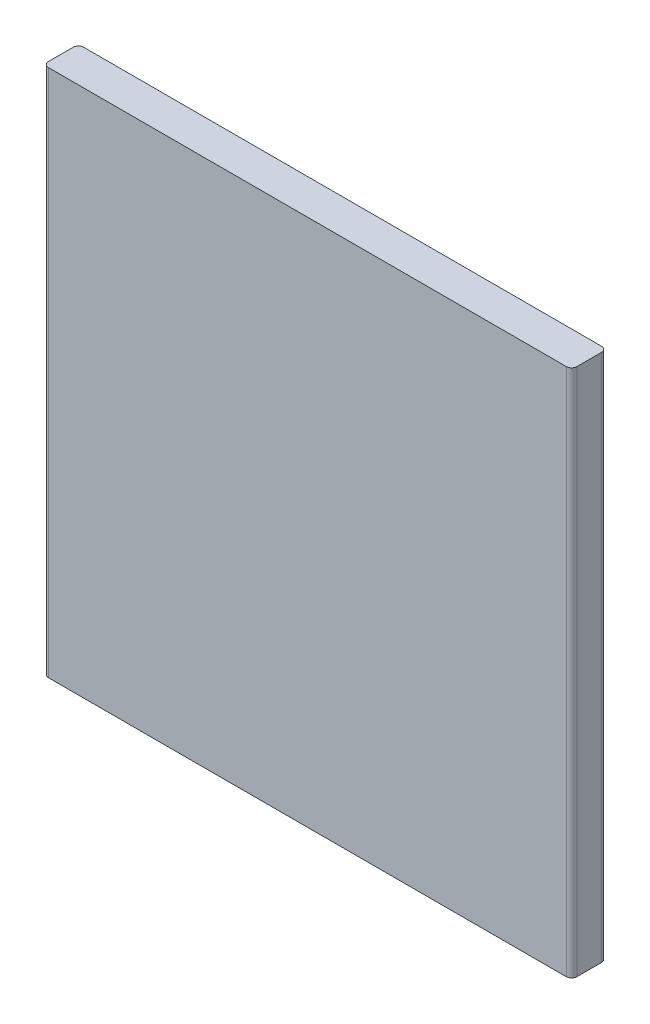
ISO-10303-21;
HEADER;
FILE_DESCRIPTION(('STEP AP214'),'2;1');
FILE_NAME('part.step','',(''),(''),'','','');
FILE_SCHEMA(('AUTOMOTIVE_DESIGN { 1 0 10303 214 1 1 1 1 }'));
ENDSEC;
DATA;
#1=APPLICATION_CONTEXT('core data for automotive mechanical design processes');
#2=APPLICATION_PROTOCOL_DEFINITION('international standard','automotive_design',2000,#1);
#3=PRODUCT_CONTEXT('',#1,'mechanical');
#4=PRODUCT('Part','Part','',(#3));
#5=PRODUCT_RELATED_PRODUCT_CATEGORY('part','',(#4));
#6=PRODUCT_DEFINITION_FORMATION('','',#4);
#7=PRODUCT_DEFINITION_CONTEXT('part definition',#1,'design');
#8=PRODUCT_DEFINITION('design','',#6,#7);
#9=PRODUCT_DEFINITION_SHAPE('','',#8);
#10=(LENGTH_UNIT() NAMED_UNIT(*) SI_UNIT(.MILLI.,.METRE.));
#11=(NAMED_UNIT(*) PLANE_ANGLE_UNIT() SI_UNIT($,.RADIAN.));
#12=(NAMED_UNIT(*) SI_UNIT($,.STERADIAN.) SOLID_ANGLE_UNIT());
#13=UNCERTAINTY_MEASURE_WITH_UNIT(LENGTH_MEASURE(1.E-05),#10,'distance_accuracy_value','');
#14=(GEOMETRIC_REPRESENTATION_CONTEXT(3) GLOBAL_UNCERTAINTY_ASSIGNED_CONTEXT((#13)) GLOBAL_UNIT_ASSIGNED_CONTEXT((#10,
#11,#12)) REPRESENTATION_CONTEXT('',''));
#15=CARTESIAN_POINT('',(0.,0.,0.));
#16=DIRECTION('',(0.,0.,1.));
#17=DIRECTION('',(1.,0.,0.));
#18=AXIS2_PLACEMENT_3D('',#15,#16,#17);
#19=CARTESIAN_POINT('',(0.,0.,2.));
#20=DIRECTION('',(1.,0.,0.));
#21=DIRECTION('',(0.,0.,-1.));
#22=AXIS2_PLACEMENT_3D('',#19,#20,#21);
#23=PLANE('',#22);
#24=DIRECTION('',(0.,0.,-1.));
#25=VECTOR('',#24,1.);
#26=CARTESIAN_POINT('',(0.,30.,2.));
#27=LINE('',#26,#25);
#28=CARTESIAN_POINT('',(0.,30.,1.7));
#29=VERTEX_POINT('',#28);
#30=CARTESIAN_POINT('',(0.,30.,0.3));
#31=VERTEX_POINT('',#30);
#32=EDGE_CURVE('E140',#29,#31,#27,.T.);
#33=ORIENTED_EDGE('',*,*,#32,.T.);
#34=DIRECTION('',(0.,-1.,0.));
#35=VECTOR('',#34,1.);
#36=CARTESIAN_POINT('',(0.,0.,0.3));
#37=LINE('',#36,#35);
#38=CARTESIAN_POINT('',(0.,0.,0.3));
#39=VERTEX_POINT('',#38);
#40=EDGE_CURVE('E11',#31,#39,#37,.T.);
#41=ORIENTED_EDGE('',*,*,#40,.T.);
#42=DIRECTION('',(0.,0.,-1.));
#43=VECTOR('',#42,1.);
#44=CARTESIAN_POINT('',(0.,0.,2.));
#45=LINE('',#44,#43);
#46=CARTESIAN_POINT('',(0.,0.,1.7));
#47=VERTEX_POINT('',#46);
#48=EDGE_CURVE('E129',#47,#39,#45,.T.);
#49=ORIENTED_EDGE('',*,*,#48,.F.);
#50=DIRECTION('',(0.,-1.,0.));
#51=VECTOR('',#50,1.);
#52=CARTESIAN_POINT('',(0.,0.,1.7));
#53=LINE('',#52,#51);
#54=EDGE_CURVE('E54',#47,#29,#53,.F.);
#55=ORIENTED_EDGE('',*,*,#54,.T.);
#56=EDGE_LOOP('',(#33,#41,#49,#55));
#57=FACE_BOUND('',#56,.T.);
#58=ADVANCED_FACE('F45',(#57),#23,.F.);
#59=CARTESIAN_POINT('',(0.,0.,2.));
#60=DIRECTION('',(0.,1.,0.));
#61=DIRECTION('',(0.,0.,1.));
#62=AXIS2_PLACEMENT_3D('',#59,#60,#61);
#63=PLANE('',#62);
#64=DIRECTION('',(0.,0.,-1.));
#65=VECTOR('',#64,1.);
#66=CARTESIAN_POINT('',(30.,0.,2.));
#67=LINE('',#66,#65);
#68=CARTESIAN_POINT('',(30.,0.,1.7));
#69=VERTEX_POINT('',#68);
#70=CARTESIAN_POINT('',(30.,0.,0.3));
#71=VERTEX_POINT('',#70);
#72=EDGE_CURVE('E156',#69,#71,#67,.T.);
#73=ORIENTED_EDGE('',*,*,#72,.F.);
#74=CARTESIAN_POINT('',(29.7,0.,1.7));
#75=DIRECTION('',(0.,1.,0.));
#76=DIRECTION('',(0.,0.,1.));
#77=AXIS2_PLACEMENT_3D('',#74,#75,#76);
#78=CIRCLE('',#77,0.3);
#79=CARTESIAN_POINT('',(29.7,0.,2.));
#80=VERTEX_POINT('',#79);
#81=EDGE_CURVE('E134',#69,#80,#78,.F.);
#82=ORIENTED_EDGE('',*,*,#81,.T.);
#83=DIRECTION('',(1.,0.,0.));
#84=VECTOR('',#83,1.);
#85=CARTESIAN_POINT('',(0.,0.,2.));
#86=LINE('',#85,#84);
#87=CARTESIAN_POINT('',(0.3,0.,2.));
#88=VERTEX_POINT('',#87);
#89=EDGE_CURVE('E123',#88,#80,#86,.T.);
#90=ORIENTED_EDGE('',*,*,#89,.F.);
#91=CARTESIAN_POINT('',(0.3,0.,1.7));
#92=DIRECTION('',(0.,1.,0.));
#93=DIRECTION('',(0.,0.,1.));
#94=AXIS2_PLACEMENT_3D('',#91,#92,#93);
#95=CIRCLE('',#94,0.3);
#96=EDGE_CURVE('E68',#88,#47,#95,.F.);
#97=ORIENTED_EDGE('',*,*,#96,.T.);
#98=ORIENTED_EDGE('',*,*,#48,.T.);
#99=CARTESIAN_POINT('',(0.3,0.,0.3));
#100=DIRECTION('',(0.,1.,0.));
#101=DIRECTION('',(0.,0.,1.));
#102=AXIS2_PLACEMENT_3D('',#99,#100,#101);
#103=CIRCLE('',#102,0.3);
#104=CARTESIAN_POINT('',(0.3,0.,0.));
#105=VERTEX_POINT('',#104);
#106=EDGE_CURVE('E61',#39,#105,#103,.F.);
#107=ORIENTED_EDGE('',*,*,#106,.T.);
#108=DIRECTION('',(1.,0.,0.));
#109=VECTOR('',#108,1.);
#110=CARTESIAN_POINT('',(0.,0.,0.));
#111=LINE('',#110,#109);
#112=CARTESIAN_POINT('',(29.7,0.,0.));
#113=VERTEX_POINT('',#112);
#114=EDGE_CURVE('E143',#105,#113,#111,.T.);
#115=ORIENTED_EDGE('',*,*,#114,.T.);
#116=CARTESIAN_POINT('',(29.7,0.,0.3));
#117=DIRECTION('',(0.,1.,0.));
#118=DIRECTION('',(0.,0.,1.));
#119=AXIS2_PLACEMENT_3D('',#116,#117,#118);
#120=CIRCLE('',#119,0.3);
#121=EDGE_CURVE('E184',#113,#71,#120,.F.);
#122=ORIENTED_EDGE('',*,*,#121,.T.);
#123=EDGE_LOOP('',(#73,#82,#90,#97,#98,#107,#115,#122));
#124=FACE_BOUND('',#123,.T.);
#125=ADVANCED_FACE('F132',(#124),#63,.F.);
#126=CARTESIAN_POINT('',(30.,0.,2.));
#127=DIRECTION('',(-1.,0.,0.));
#128=DIRECTION('',(0.,0.,1.));
#129=AXIS2_PLACEMENT_3D('',#126,#127,#128);
#130=PLANE('',#129);
#131=DIRECTION('',(0.,0.,-1.));
#132=VECTOR('',#131,1.);
#133=CARTESIAN_POINT('',(30.,30.,2.));
#134=LINE('',#133,#132);
#135=CARTESIAN_POINT('',(30.,30.,1.7));
#136=VERTEX_POINT('',#135);
#137=CARTESIAN_POINT('',(30.,30.,0.3));
#138=VERTEX_POINT('',#137);
#139=EDGE_CURVE('E152',#136,#138,#134,.T.);
#140=ORIENTED_EDGE('',*,*,#139,.F.);
#141=DIRECTION('',(0.,1.,0.));
#142=VECTOR('',#141,1.);
#143=CARTESIAN_POINT('',(30.,0.,1.7));
#144=LINE('',#143,#142);
#145=EDGE_CURVE('E116',#136,#69,#144,.F.);
#146=ORIENTED_EDGE('',*,*,#145,.T.);
#147=ORIENTED_EDGE('',*,*,#72,.T.);
#148=DIRECTION('',(0.,1.,0.));
#149=VECTOR('',#148,1.);
#150=CARTESIAN_POINT('',(30.,30.,0.3));
#151=LINE('',#150,#149);
#152=EDGE_CURVE('E176',#71,#138,#151,.T.);
#153=ORIENTED_EDGE('',*,*,#152,.T.);
#154=EDGE_LOOP('',(#140,#146,#147,#153));
#155=FACE_BOUND('',#154,.T.);
#156=ADVANCED_FACE('F212',(#155),#130,.F.);
#157=CARTESIAN_POINT('',(0.,30.,2.));
#158=DIRECTION('',(0.,-1.,0.));
#159=DIRECTION('',(0.,0.,-1.));
#160=AXIS2_PLACEMENT_3D('',#157,#158,#159);
#161=PLANE('',#160);
#162=DIRECTION('',(-1.,0.,0.));
#163=VECTOR('',#162,1.);
#164=CARTESIAN_POINT('',(0.,30.,2.));
#165=LINE('',#164,#163);
#166=CARTESIAN_POINT('',(29.7,30.,2.));
#167=VERTEX_POINT('',#166);
#168=CARTESIAN_POINT('',(0.3,30.,2.));
#169=VERTEX_POINT('',#168);
#170=EDGE_CURVE('E126',#167,#169,#165,.T.);
#171=ORIENTED_EDGE('',*,*,#170,.F.);
#172=CARTESIAN_POINT('',(29.7,30.,1.7));
#173=DIRECTION('',(0.,-1.,0.));
#174=DIRECTION('',(0.,0.,-1.));
#175=AXIS2_PLACEMENT_3D('',#172,#173,#174);
#176=CIRCLE('',#175,0.3);
#177=EDGE_CURVE('E173',#167,#136,#176,.F.);
#178=ORIENTED_EDGE('',*,*,#177,.T.);
#179=ORIENTED_EDGE('',*,*,#139,.T.);
#180=CARTESIAN_POINT('',(29.7,30.,0.3));
#181=DIRECTION('',(0.,-1.,0.));
#182=DIRECTION('',(0.,0.,-1.));
#183=AXIS2_PLACEMENT_3D('',#180,#181,#182);
#184=CIRCLE('',#183,0.3);
#185=CARTESIAN_POINT('',(29.7,30.,0.));
#186=VERTEX_POINT('',#185);
#187=EDGE_CURVE('E170',#138,#186,#184,.F.);
#188=ORIENTED_EDGE('',*,*,#187,.T.);
#189=DIRECTION('',(-1.,0.,0.));
#190=VECTOR('',#189,1.);
#191=CARTESIAN_POINT('',(0.,30.,0.));
#192=LINE('',#191,#190);
#193=CARTESIAN_POINT('',(0.3,30.,0.));
#194=VERTEX_POINT('',#193);
#195=EDGE_CURVE('E136',#186,#194,#192,.T.);
#196=ORIENTED_EDGE('',*,*,#195,.T.);
#197=CARTESIAN_POINT('',(0.3,30.,0.3));
#198=DIRECTION('',(0.,-1.,0.));
#199=DIRECTION('',(0.,0.,-1.));
#200=AXIS2_PLACEMENT_3D('',#197,#198,#199);
#201=CIRCLE('',#200,0.3);
#202=EDGE_CURVE('E167',#194,#31,#201,.F.);
#203=ORIENTED_EDGE('',*,*,#202,.T.);
#204=ORIENTED_EDGE('',*,*,#32,.F.);
#205=CARTESIAN_POINT('',(0.3,30.,1.7));
#206=DIRECTION('',(0.,-1.,0.));
#207=DIRECTION('',(0.,0.,-1.));
#208=AXIS2_PLACEMENT_3D('',#205,#206,#207);
#209=CIRCLE('',#208,0.3);
#210=EDGE_CURVE('E164',#29,#169,#209,.F.);
#211=ORIENTED_EDGE('',*,*,#210,.T.);
#212=EDGE_LOOP('',(#171,#178,#179,#188,#196,#203,#204,#211));
#213=FACE_BOUND('',#212,.T.);
#214=ADVANCED_FACE('F198',(#213),#161,.F.);
#215=CARTESIAN_POINT('',(0.,0.,2.));
#216=DIRECTION('',(0.,0.,-1.));
#217=DIRECTION('',(-1.,0.,0.));
#218=AXIS2_PLACEMENT_3D('',#215,#216,#217);
#219=PLANE('',#218);
#220=ORIENTED_EDGE('',*,*,#89,.T.);
#221=DIRECTION('',(0.,1.,0.));
#222=VECTOR('',#221,1.);
#223=CARTESIAN_POINT('',(29.7,0.,2.));
#224=LINE('',#223,#222);
#225=EDGE_CURVE('E128',#80,#167,#224,.T.);
#226=ORIENTED_EDGE('',*,*,#225,.T.);
#227=ORIENTED_EDGE('',*,*,#170,.T.);
#228=DIRECTION('',(0.,-1.,0.));
#229=VECTOR('',#228,1.);
#230=CARTESIAN_POINT('',(0.3,0.,2.));
#231=LINE('',#230,#229);
#232=EDGE_CURVE('E114',#169,#88,#231,.T.);
#233=ORIENTED_EDGE('',*,*,#232,.T.);
#234=EDGE_LOOP('',(#220,#226,#227,#233));
#235=FACE_BOUND('',#234,.T.);
#236=ADVANCED_FACE('F121',(#235),#219,.F.);
#237=CARTESIAN_POINT('',(0.,0.,0.));
#238=DIRECTION('',(0.,0.,-1.));
#239=DIRECTION('',(-1.,0.,0.));
#240=AXIS2_PLACEMENT_3D('',#237,#238,#239);
#241=PLANE('',#240);
#242=ORIENTED_EDGE('',*,*,#195,.F.);
#243=DIRECTION('',(0.,1.,0.));
#244=VECTOR('',#243,1.);
#245=CARTESIAN_POINT('',(29.7,0.,0.));
#246=LINE('',#245,#244);
#247=EDGE_CURVE('E192',#186,#113,#246,.F.);
#248=ORIENTED_EDGE('',*,*,#247,.T.);
#249=ORIENTED_EDGE('',*,*,#114,.F.);
#250=DIRECTION('',(0.,-1.,0.));
#251=VECTOR('',#250,1.);
#252=CARTESIAN_POINT('',(0.3,30.,0.));
#253=LINE('',#252,#251);
#254=EDGE_CURVE('E189',#105,#194,#253,.F.);
#255=ORIENTED_EDGE('',*,*,#254,.T.);
#256=EDGE_LOOP('',(#242,#248,#249,#255));
#257=FACE_BOUND('',#256,.T.);
#258=ADVANCED_FACE('F205',(#257),#241,.T.);
#259=CARTESIAN_POINT('',(29.7,0.,1.7));
#260=DIRECTION('',(0.,1.,0.));
#261=DIRECTION('',(0.,0.,1.));
#262=AXIS2_PLACEMENT_3D('',#259,#260,#261);
#263=CYLINDRICAL_SURFACE('',#262,0.3);
#264=ORIENTED_EDGE('',*,*,#81,.F.);
#265=ORIENTED_EDGE('',*,*,#145,.F.);
#266=ORIENTED_EDGE('',*,*,#177,.F.);
#267=ORIENTED_EDGE('',*,*,#225,.F.);
#268=EDGE_LOOP('',(#264,#265,#266,#267));
#269=FACE_BOUND('',#268,.T.);
#270=ADVANCED_FACE('F215',(#269),#263,.T.);
#271=CARTESIAN_POINT('',(29.7,0.,0.3));
#272=DIRECTION('',(0.,-1.,0.));
#273=DIRECTION('',(0.,0.,-1.));
#274=AXIS2_PLACEMENT_3D('',#271,#272,#273);
#275=CYLINDRICAL_SURFACE('',#274,0.3);
#276=ORIENTED_EDGE('',*,*,#121,.F.);
#277=ORIENTED_EDGE('',*,*,#247,.F.);
#278=ORIENTED_EDGE('',*,*,#187,.F.);
#279=ORIENTED_EDGE('',*,*,#152,.F.);
#280=EDGE_LOOP('',(#276,#277,#278,#279));
#281=FACE_BOUND('',#280,.T.);
#282=ADVANCED_FACE('F208',(#281),#275,.T.);
#283=CARTESIAN_POINT('',(0.3,0.,0.3));
#284=DIRECTION('',(0.,1.,0.));
#285=DIRECTION('',(0.,0.,1.));
#286=AXIS2_PLACEMENT_3D('',#283,#284,#285);
#287=CYLINDRICAL_SURFACE('',#286,0.3);
#288=ORIENTED_EDGE('',*,*,#202,.F.);
#289=ORIENTED_EDGE('',*,*,#254,.F.);
#290=ORIENTED_EDGE('',*,*,#106,.F.);
#291=ORIENTED_EDGE('',*,*,#40,.F.);
#292=EDGE_LOOP('',(#288,#289,#290,#291));
#293=FACE_BOUND('',#292,.T.);
#294=ADVANCED_FACE('F201',(#293),#287,.T.);
#295=CARTESIAN_POINT('',(0.3,0.,1.7));
#296=DIRECTION('',(0.,-1.,0.));
#297=DIRECTION('',(0.,0.,-1.));
#298=AXIS2_PLACEMENT_3D('',#295,#296,#297);
#299=CYLINDRICAL_SURFACE('',#298,0.3);
#300=ORIENTED_EDGE('',*,*,#210,.F.);
#301=ORIENTED_EDGE('',*,*,#54,.F.);
#302=ORIENTED_EDGE('',*,*,#96,.F.);
#303=ORIENTED_EDGE('',*,*,#232,.F.);
#304=EDGE_LOOP('',(#300,#301,#302,#303));
#305=FACE_BOUND('',#304,.T.);
#306=ADVANCED_FACE('F47',(#305),#299,.T.);
#307=CLOSED_SHELL('',(#58,#125,#156,#214,#236,#258,#270,#282,#294,#306));
#308=MANIFOLD_SOLID_BREP('B2',#307);
#309=ADVANCED_BREP_SHAPE_REPRESENTATION('',(#18,#308),#14);
#310=SHAPE_DEFINITION_REPRESENTATION(#9,#309);
ENDSEC;
END-ISO-10303-21;
